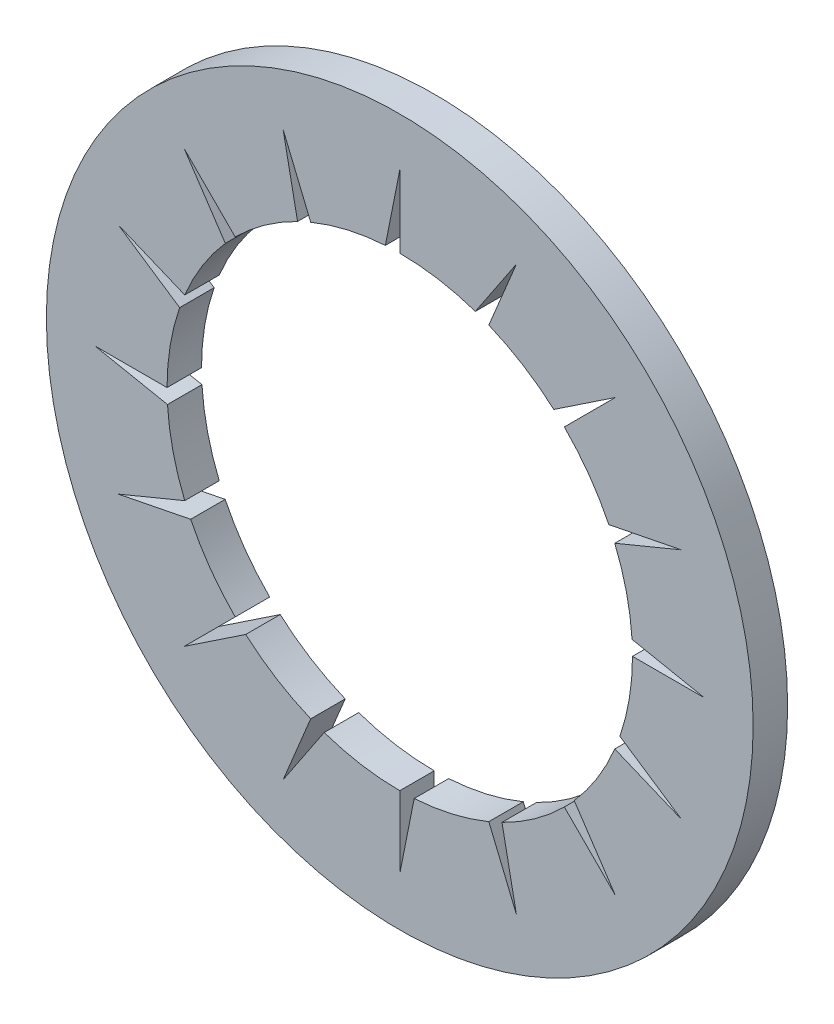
from build123d import *

# Parameters (mm, degrees)
BODYSKE_W      = 3.5
BODYSKE_H      = 1
TOOTHCUT_DEPTH = 15.530141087
TOOTHPAT_COUNT = 16


with BuildPart() as part:
    # BodySke → BaseBody (revolve)
    with BuildSketch(Plane(origin=(0, 0, 0), x_dir=(1, 0, 0), z_dir=(0, 1, 0))):
        with Locations((8.5, 0.5)):
            Rectangle(BODYSKE_W, BODYSKE_H)
    revolve(axis=Axis((0, 0, 0), (0, 0, -1)))

    # ToothSke → ToothCut (cut, through all)
    with BuildSketch(Plane.XY):
        with BuildLine():
            Line((0, 8.84), (-0.418307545, 6.737025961))
            ThreePointArc((-0.418307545, 6.737025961), (-0.209254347, 6.746755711), (0, 6.75))
            Line((0, 6.75), (0, 8.84))
        make_face()
    toothcut = extrude(amount=-TOOTHCUT_DEPTH, mode=Mode.SUBTRACT)

    # ToothPat: ToothCut ×16 about axis
    toothpat_axis = Axis((0, 0, 0), (0, 0, 1))
    for i in range(1, TOOTHPAT_COUNT):
        add(toothcut.rotate(toothpat_axis, i * 360 / TOOTHPAT_COUNT), mode=Mode.SUBTRACT)


solid = part.part
